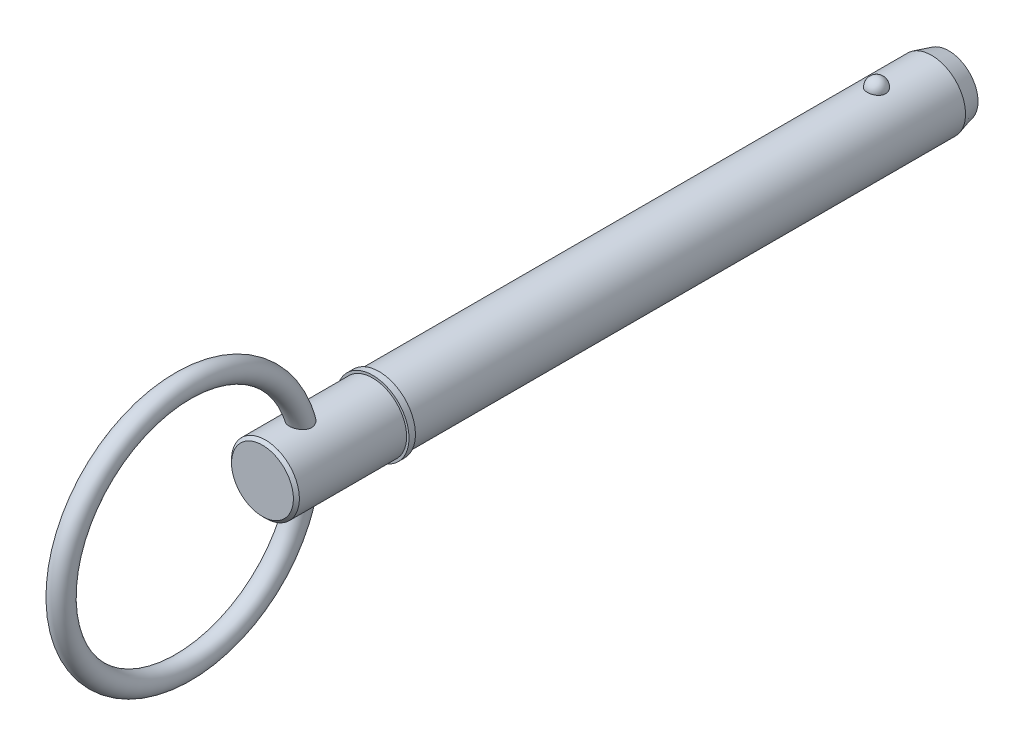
from build123d import *

# Parameters (mm, degrees)
SKETCH2_R           = 7.94
BOSS_EXTRUDE1_DEPTH = 114.3
BOSS_EXTRUDE2_START = 19.05
SKETCH3_R           = 7.94
BOSS_EXTRUDE2_DEPTH = 19.05
CHAMFER1_SIZE       = 4
CHAMFER1_SIZE2      = 1.07179677
SKETCH20_W          = 1.5
SKETCH20_H          = 8.5
SKETCH21_R          = 7.94
BOSS_EXTRUDE3_DEPTH = 27.31
CHAMFER2_SIZE       = 0.7
SKETCH24_R          = 2.5


with BuildPart() as part:
    # Sketch2 → Boss-Extrude1 (new body)
    with BuildSketch(Plane.XY):
        Circle(SKETCH2_R)
    extrude(amount=BOSS_EXTRUDE1_DEPTH)

    # Sketch3 → Boss-Extrude2 (add)
    with BuildSketch(Plane(origin=(0, 0, 0), x_dir=(-1, 0, 0), z_dir=(0, 0, -1)).offset(BOSS_EXTRUDE2_START)):
        Circle(SKETCH3_R)
    extrude(amount=-BOSS_EXTRUDE2_DEPTH)

    # Chamfer1
    chamfer1_edges = [part.edges().sort_by_distance(p)[0] for p in [
        (7.94, 0, -19.05),
    ]]
    chamfer1_side = [part.faces().sort_by_distance(p)[0] for p in [
        (7.94, 0, -9.525),
    ]]
    chamfer(chamfer1_edges, length=CHAMFER1_SIZE, length2=CHAMFER1_SIZE2, reference=chamfer1_side[0])

    # Sketch18 → Revolve1 (revolve)
    with BuildSketch(Plane(origin=(0, 0, 0), x_dir=(0, 0, -1), z_dir=(1, 0, 0))):
        with BuildLine():
            Line((2.15, 10.09), (2.15, 5.79))
            ThreePointArc((2.15, 5.79), (0, 7.94), (2.15, 10.09))
        make_face()
    revolve(axis=Axis((0, 10.09, -2.15), (0, -1, 0)))

    # Sketch20 → Revolve2 (revolve)
    with BuildSketch(Plane(origin=(0, 0, 0), x_dir=(0, 0, -1), z_dir=(1, 0, 0)), mode=Mode.PRIVATE) as revolve2_sk:
        with Locations((-115.05, 4.25)):
            Rectangle(SKETCH20_W, SKETCH20_H)
    revolve(revolve2_sk.sketch.rotate(Axis((0, 0, 33.728787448), (0, 0, 1)), 90), axis=Axis((0, 0, 33.728787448), (0, 0, 1)))

    # Sketch21 → Boss-Extrude3 (add)
    with BuildSketch(Plane(origin=(0, 0, 114.3), x_dir=(-1, 0, 0), z_dir=(0, 0, -1))):
        Circle(SKETCH21_R)
    extrude(amount=-BOSS_EXTRUDE3_DEPTH)

    # Chamfer2
    chamfer2_edges = [part.edges().sort_by_distance(p)[0] for p in [
        (7.94, 0, 141.61),
    ]]
    chamfer(chamfer2_edges, length=CHAMFER2_SIZE)

    # Sweep1: sweep along a path in Sketch23
    with BuildLine(Plane(origin=(0, 0, 0), x_dir=(0, 0, -1), z_dir=(1, 0, 0))) as sweep1_path:
        CenterArc((-160.185, 0), 28.575, 0, 360)
    # Sketch24 → Sweep1 (sweep)
    with BuildSketch(Plane(origin=(0, 0, 0), x_dir=(1, 0, 0), z_dir=(0, 1, 0))):
        with Locations((0, -131.61)):
            Circle(SKETCH24_R)
    sweep(path=sweep1_path.line)


solid = part.part
